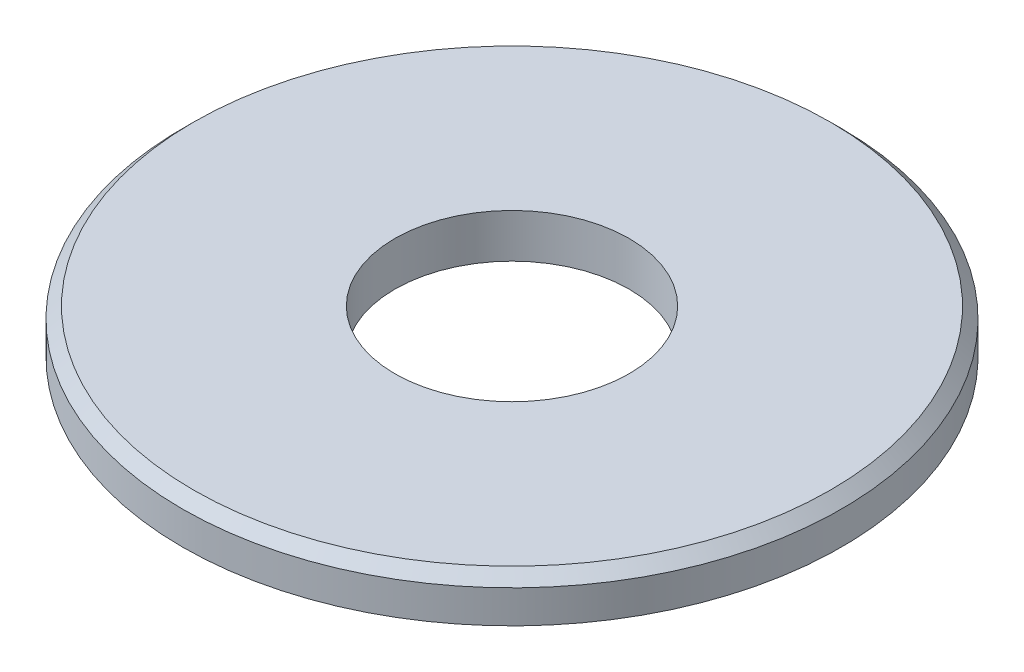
ISO-10303-21;
HEADER;
FILE_DESCRIPTION(('STEP AP214'),'2;1');
FILE_NAME('part.step','',(''),(''),'','','');
FILE_SCHEMA(('AUTOMOTIVE_DESIGN { 1 0 10303 214 1 1 1 1 }'));
ENDSEC;
DATA;
#1=APPLICATION_CONTEXT('core data for automotive mechanical design processes');
#2=APPLICATION_PROTOCOL_DEFINITION('international standard','automotive_design',2000,#1);
#3=PRODUCT_CONTEXT('',#1,'mechanical');
#4=PRODUCT('Part','Part','',(#3));
#5=PRODUCT_RELATED_PRODUCT_CATEGORY('part','',(#4));
#6=PRODUCT_DEFINITION_FORMATION('','',#4);
#7=PRODUCT_DEFINITION_CONTEXT('part definition',#1,'design');
#8=PRODUCT_DEFINITION('design','',#6,#7);
#9=PRODUCT_DEFINITION_SHAPE('','',#8);
#10=(LENGTH_UNIT() NAMED_UNIT(*) SI_UNIT(.MILLI.,.METRE.));
#11=(NAMED_UNIT(*) PLANE_ANGLE_UNIT() SI_UNIT($,.RADIAN.));
#12=(NAMED_UNIT(*) SI_UNIT($,.STERADIAN.) SOLID_ANGLE_UNIT());
#13=UNCERTAINTY_MEASURE_WITH_UNIT(LENGTH_MEASURE(1.E-05),#10,'distance_accuracy_value','');
#14=(GEOMETRIC_REPRESENTATION_CONTEXT(3) GLOBAL_UNCERTAINTY_ASSIGNED_CONTEXT((#13)) GLOBAL_UNIT_ASSIGNED_CONTEXT((#10,
#11,#12)) REPRESENTATION_CONTEXT('',''));
#15=CARTESIAN_POINT('',(0.,0.,0.));
#16=DIRECTION('',(0.,0.,1.));
#17=DIRECTION('',(1.,0.,0.));
#18=AXIS2_PLACEMENT_3D('',#15,#16,#17);
#19=CARTESIAN_POINT('',(0.,1.2,0.));
#20=DIRECTION('',(0.,1.,0.));
#21=DIRECTION('',(0.,0.,1.));
#22=AXIS2_PLACEMENT_3D('',#19,#20,#21);
#23=PLANE('',#22);
#24=CARTESIAN_POINT('',(0.,1.2,0.));
#25=DIRECTION('',(0.,1.,0.));
#26=DIRECTION('',(0.,0.,1.));
#27=AXIS2_PLACEMENT_3D('',#24,#25,#26);
#28=CIRCLE('',#27,8.7);
#29=CARTESIAN_POINT('',(0.,1.2,8.7));
#30=VERTEX_POINT('',#29);
#31=EDGE_CURVE('E38',#30,#30,#28,.T.);
#32=ORIENTED_EDGE('',*,*,#31,.T.);
#33=EDGE_LOOP('',(#32));
#34=FACE_BOUND('',#33,.T.);
#35=CARTESIAN_POINT('',(0.,1.2,0.));
#36=DIRECTION('',(0.,1.,0.));
#37=DIRECTION('',(0.,0.,1.));
#38=AXIS2_PLACEMENT_3D('',#35,#36,#37);
#39=CIRCLE('',#38,3.2);
#40=CARTESIAN_POINT('',(0.,1.2,3.2));
#41=VERTEX_POINT('',#40);
#42=EDGE_CURVE('E46',#41,#41,#39,.T.);
#43=ORIENTED_EDGE('',*,*,#42,.F.);
#44=EDGE_LOOP('',(#43));
#45=FACE_BOUND('',#44,.T.);
#46=ADVANCED_FACE('F31',(#34,#45),#23,.T.);
#47=CARTESIAN_POINT('',(0.,0.,0.));
#48=DIRECTION('',(0.,1.,0.));
#49=DIRECTION('',(0.,0.,1.));
#50=AXIS2_PLACEMENT_3D('',#47,#48,#49);
#51=PLANE('',#50);
#52=CARTESIAN_POINT('',(0.,0.,0.));
#53=DIRECTION('',(0.,1.,0.));
#54=DIRECTION('',(0.,0.,1.));
#55=AXIS2_PLACEMENT_3D('',#52,#53,#54);
#56=CIRCLE('',#55,9.);
#57=CARTESIAN_POINT('',(0.,0.,9.));
#58=VERTEX_POINT('',#57);
#59=EDGE_CURVE('E42',#58,#58,#56,.T.);
#60=ORIENTED_EDGE('',*,*,#59,.F.);
#61=EDGE_LOOP('',(#60));
#62=FACE_BOUND('',#61,.T.);
#63=CARTESIAN_POINT('',(0.,0.,0.));
#64=DIRECTION('',(0.,1.,0.));
#65=DIRECTION('',(0.,0.,1.));
#66=AXIS2_PLACEMENT_3D('',#63,#64,#65);
#67=CIRCLE('',#66,3.2);
#68=CARTESIAN_POINT('',(0.,0.,3.2));
#69=VERTEX_POINT('',#68);
#70=EDGE_CURVE('E49',#69,#69,#67,.T.);
#71=ORIENTED_EDGE('',*,*,#70,.T.);
#72=EDGE_LOOP('',(#71));
#73=FACE_BOUND('',#72,.T.);
#74=ADVANCED_FACE('F59',(#62,#73),#51,.F.);
#75=CARTESIAN_POINT('',(0.,1.2,0.));
#76=DIRECTION('',(0.,-1.,0.));
#77=DIRECTION('',(0.,0.,-1.));
#78=AXIS2_PLACEMENT_3D('',#75,#76,#77);
#79=CYLINDRICAL_SURFACE('',#78,9.);
#80=CARTESIAN_POINT('',(0.,0.9,0.));
#81=DIRECTION('',(0.,1.,0.));
#82=DIRECTION('',(0.,0.,1.));
#83=AXIS2_PLACEMENT_3D('',#80,#81,#82);
#84=CIRCLE('',#83,9.);
#85=CARTESIAN_POINT('',(0.,0.9,9.));
#86=VERTEX_POINT('',#85);
#87=EDGE_CURVE('E10',#86,#86,#84,.F.);
#88=ORIENTED_EDGE('',*,*,#87,.T.);
#89=EDGE_LOOP('',(#88));
#90=FACE_BOUND('',#89,.T.);
#91=ORIENTED_EDGE('',*,*,#59,.T.);
#92=EDGE_LOOP('',(#91));
#93=FACE_BOUND('',#92,.T.);
#94=ADVANCED_FACE('F64',(#90,#93),#79,.T.);
#95=CARTESIAN_POINT('',(0.,1.2,0.));
#96=DIRECTION('',(0.,-1.,0.));
#97=DIRECTION('',(0.,0.,-1.));
#98=AXIS2_PLACEMENT_3D('',#95,#96,#97);
#99=CYLINDRICAL_SURFACE('',#98,3.2);
#100=ORIENTED_EDGE('',*,*,#42,.T.);
#101=EDGE_LOOP('',(#100));
#102=FACE_BOUND('',#101,.T.);
#103=ORIENTED_EDGE('',*,*,#70,.F.);
#104=EDGE_LOOP('',(#103));
#105=FACE_BOUND('',#104,.T.);
#106=ADVANCED_FACE('F55',(#102,#105),#99,.F.);
#107=CARTESIAN_POINT('',(0.,1.2,0.));
#108=DIRECTION('',(0.,-1.,0.));
#109=DIRECTION('',(0.,0.,-1.));
#110=AXIS2_PLACEMENT_3D('',#107,#108,#109);
#111=CONICAL_SURFACE('',#110,8.7,0.785398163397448);
#112=ORIENTED_EDGE('',*,*,#87,.F.);
#113=EDGE_LOOP('',(#112));
#114=FACE_BOUND('',#113,.T.);
#115=ORIENTED_EDGE('',*,*,#31,.F.);
#116=EDGE_LOOP('',(#115));
#117=FACE_BOUND('',#116,.T.);
#118=ADVANCED_FACE('F33',(#114,#117),#111,.T.);
#119=CLOSED_SHELL('',(#46,#74,#94,#106,#118));
#120=MANIFOLD_SOLID_BREP('B2',#119);
#121=ADVANCED_BREP_SHAPE_REPRESENTATION('',(#18,#120),#14);
#122=SHAPE_DEFINITION_REPRESENTATION(#9,#121);
ENDSEC;
END-ISO-10303-21;
